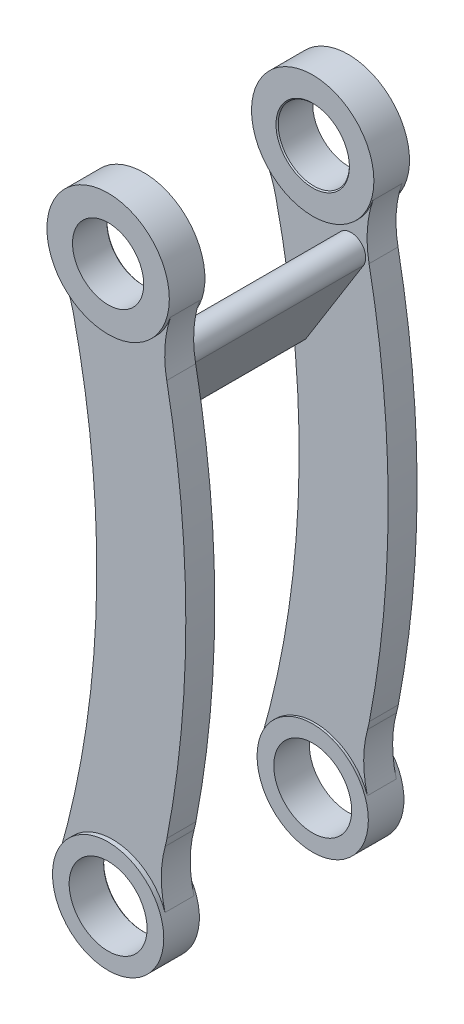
from build123d import *
from build123d.topology import SkipClean

# Parameters (mm, degrees)
BASE_EXTRUSION_DEPTH       = 13
ESQUISSE2_R                = 27.5
ESQUISSE2_R_2              = 25
BOSS_EXTRU_1_DEPTH         = 1
BOSS_EXTRU_2_START         = 2
ESQUISSE3_R                = 25
ESQUISSE3_R_2              = 27.5
BOSS_EXTRU_2_DEPTH         = 2
ESQUISSE4_R                = 16
ENL_V_MAT_EXTRU_1_DEPTH    = 211.701396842
BOSS_EXTRU_3_DEPTH         = 77.92
CHANFREIN3_SIZE            = 0.5
R_P_TITION_LIN_AIRE1_COUNT = 2
R_P_TITION_LIN_AIRE1_PITCH = 90.92
BOSS_EXTRU_4_START         = 1
ESQUISSE6_R                = 27.5
ESQUISSE6_R_2              = 25
BOSS_EXTRU_4_DEPTH         = 1
ESQUISSE7_R                = 27.5
ESQUISSE7_R_2              = 25
BOSS_EXTRU_5_DEPTH         = 2
ESQUISSE8_R                = 16
ESQUISSE8_R_2              = 17.5
ENL_V_MAT_EXTRU_2_DEPTH    = 237.190188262
CHANFREIN5_SIZE            = 0.5


with BuildPart() as part:
    # Esquisse1 → Base-Extrusion (new body)
    with BuildSketch(Plane.XY):
        with BuildLine():
            ThreePointArc((26.055578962, 171.204728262), (-2.960297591, 207.340201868), (-23.569149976, 165.831543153))
            ThreePointArc((-23.569149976, 165.831543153), (-20.019541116, 158.693222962), (-17.649585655, 151.081478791))
            ThreePointArc((-17.649585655, 151.081478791), (-7.283560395, 43.610124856), (-24.01613398, -63.055555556))
            ThreePointArc((-24.01613398, -63.055555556), (0.722053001, -94.989570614), (23.575093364, -61.680446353))
            ThreePointArc((23.575093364, -61.680446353), (21.916904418, -48.803501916), (23.630013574, -35.933748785))
            ThreePointArc((23.630013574, -35.933748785), (24.068424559, -34.175899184), (24.44286445, -32.403320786))
            ThreePointArc((24.44286445, -32.403320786), (32.906284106, 56.658715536), (24.34060915, 145.710975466))
            ThreePointArc((24.34060915, 145.710975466), (23.542108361, 158.569250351), (26.055578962, 171.204728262))
        make_face()
    base_extrusion = extrude(amount=BASE_EXTRUSION_DEPTH)

    # Esquisse2 → Boss.-Extru.1 (add)
    with BuildSketch(Plane.XY.offset(13)):
        with Locations(Location((0, 180, 0), (0, 0, 211.011934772))):
            Circle(ESQUISSE2_R)
        with Locations(Location((0, -70, 0), (0, 0, 163.872379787))):
            Circle(ESQUISSE2_R_2)
    extrude(amount=BOSS_EXTRU_1_DEPTH)

    # Esquisse3 → Boss.-Extru.2 (add)
    with SkipClean():  # the faces are left unmerged after this step: merging them gives an invalid solid
        with BuildSketch(Plane(origin=(0, 0, 0), x_dir=(-1, 0, 0), z_dir=(0, 0, -1)).offset(BOSS_EXTRU_2_START)):
            with Locations((0, -70)):
                Circle(ESQUISSE3_R)
            with Locations((0, 180)):
                Circle(ESQUISSE3_R_2)
        extrude(amount=-BOSS_EXTRU_2_DEPTH)

    # Esquisse4 → Enl_v. mat.-Extru.1 (cut, through all)
    with SkipClean():  # the faces are left unmerged after this step: merging them gives an invalid solid
        with BuildSketch(Plane.XY.offset(14)):
            with Locations((0, 180)):
                Circle(ESQUISSE4_R)
            with Locations((0, -70)):
                Circle(ESQUISSE4_R)
        extrude(amount=-ENL_V_MAT_EXTRU_1_DEPTH, mode=Mode.SUBTRACT)

    # Esquisse5 → Boss.-Extru.3 (add)
    with SkipClean():  # the faces are left unmerged after this step: merging them gives an invalid solid
        with BuildSketch(Plane.XY.offset(13)):
            with BuildLine():
                Line((21.824103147, 143.765744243), (-4.024752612, 102.348827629))
                ThreePointArc((-4.024752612, 102.348827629), (-7.968380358, 101.2831738), (-9.318685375, 105.138623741))
                Line((-9.318685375, 105.138623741), (10.232997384, 149.874023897))
                ThreePointArc((10.232997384, 149.874023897), (19.314075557, 153.054515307), (21.824103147, 143.765744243))
            make_face()
        extrude(amount=BOSS_EXTRU_3_DEPTH)

    # Chanfrein3
    chanfrein3_edges = [part.edges().sort_by_distance(p)[0] for p in [
        (-16, 180, 14),
        (-16, -70, 14),
    ]]
    chamfer(chanfrein3_edges, length=CHANFREIN3_SIZE)

    # R_p_tition lin_aire1: Base-Extrusion ×2
    with SkipClean():  # the faces are left unmerged after this step: merging them gives an invalid solid
        with Locations(*[(0, 0, i * R_P_TITION_LIN_AIRE1_PITCH) for i in range(1, R_P_TITION_LIN_AIRE1_COUNT)]):
            add(base_extrusion)

    # Esquisse6 → Boss.-Extru.4 (add)
    with BuildSketch(Plane(origin=(0, 0, 90.92), x_dir=(-1, 0, 0), z_dir=(0, 0, -1)).offset(BOSS_EXTRU_4_START)):
        with Locations((0, 180)):
            Circle(ESQUISSE6_R)
        with Locations((0, -70)):
            Circle(ESQUISSE6_R_2)
    extrude(amount=-BOSS_EXTRU_4_DEPTH)

    # Esquisse7 → Boss.-Extru.5 (add)
    with BuildSketch(Plane.XY.offset(103.92)):
        with Locations(Location((0, 180, 0), (0, 0, 180))):
            Circle(ESQUISSE7_R)
        with Locations(Location((0, -70, 0), (0, 0, 180))):
            Circle(ESQUISSE7_R_2)
    extrude(amount=BOSS_EXTRU_5_DEPTH)

    # Esquisse8 → Enl_v. mat.-Extru.2 (cut, through all)
    with BuildSketch(Plane.XY.offset(105.92)):
        with Locations((0, 180)):
            Circle(ESQUISSE8_R)
        with Locations((0, -70)):
            Circle(ESQUISSE8_R_2)
    extrude(amount=-ENL_V_MAT_EXTRU_2_DEPTH, mode=Mode.SUBTRACT)

    # Chanfrein5
    chanfrein5_edges = [part.edges().sort_by_distance(p)[0] for p in [
        (-16, 180, 89.92),
        (-17.5, -70, 89.92),
    ]]
    chamfer(chanfrein5_edges, length=CHANFREIN5_SIZE)


solid = part.part
